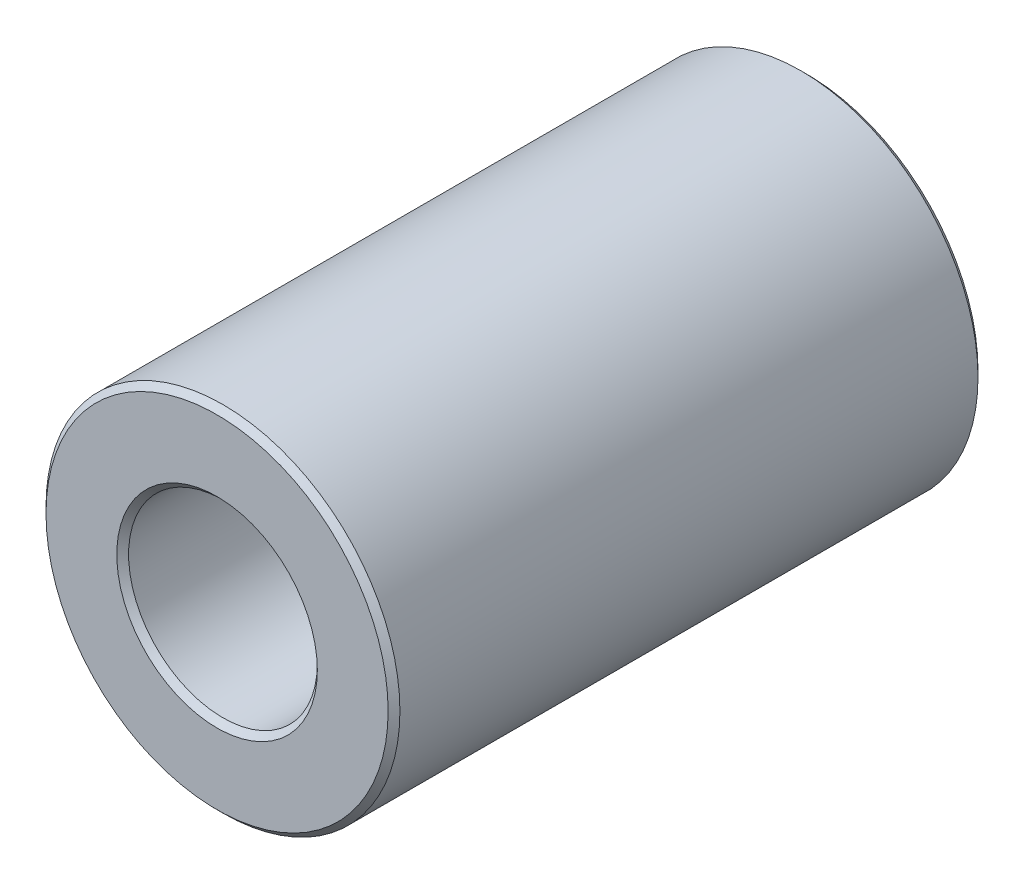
from build123d import *

# Parameters (mm, degrees)
SKETCH1_R           = 3
SKETCH1_R_2         = 1.6
BOSS_EXTRUDE2_DEPTH = 5
CHAMFER3_SIZE       = 0.1


with BuildPart() as part:
    # Sketch1 → Boss-Extrude2 (new, symmetric)
    with BuildSketch(Plane.XY):
        Circle(SKETCH1_R)
        Circle(SKETCH1_R_2, mode=Mode.SUBTRACT)
    extrude(amount=BOSS_EXTRUDE2_DEPTH, both=True)

    # Chamfer3
    chamfer3_edges = [part.edges().sort_by_distance(p)[0] for p in [
        (-3, 0, -5),
        (-3, 0, 5),
        (-1.6, 0, -5),
        (-1.6, 0, 5),
    ]]
    chamfer(chamfer3_edges, length=CHAMFER3_SIZE)


solid = part.part
